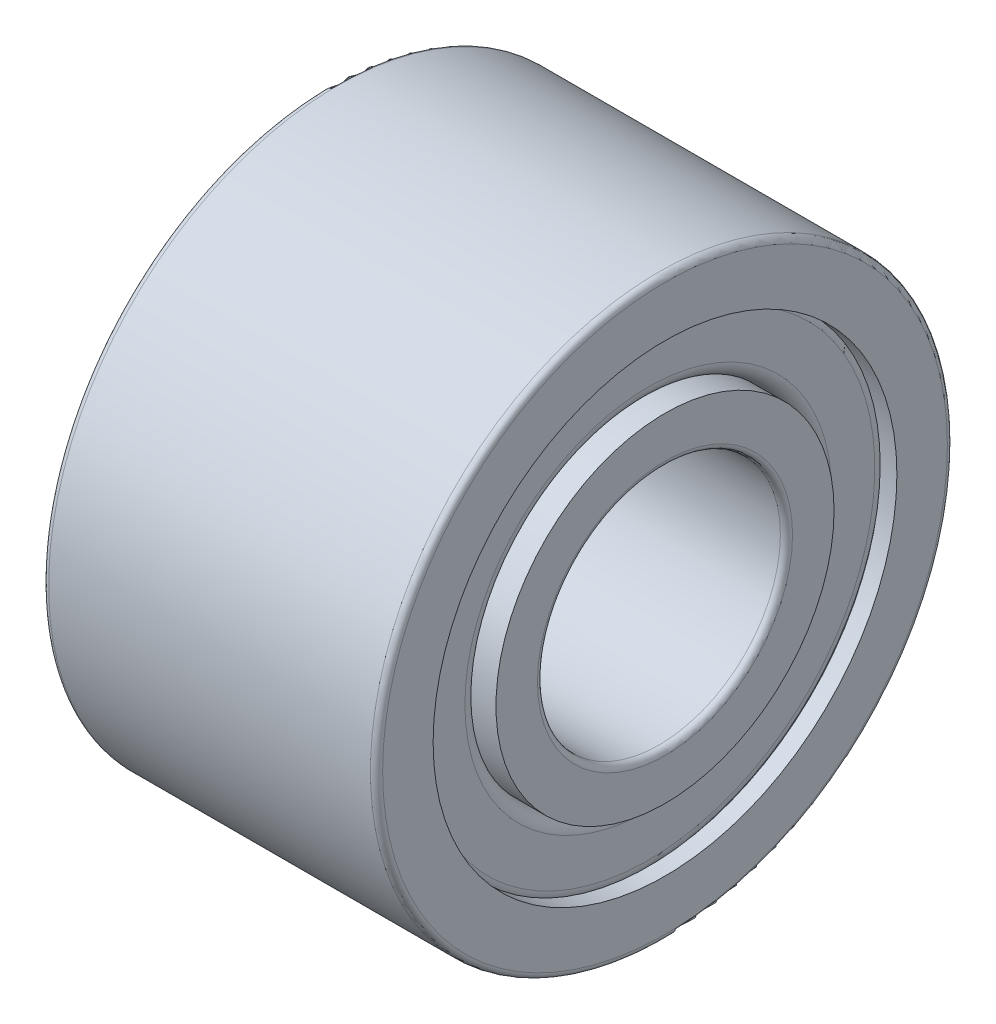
from build123d import *


with BuildPart() as part:
    # OutRacSke → OuterRace (revolve)
    with BuildSketch(Plane.XY, mode=Mode.PRIVATE) as outerrace_sk:
        with BuildLine():
            Line((-4.95, 7.9325), (-4.95, 7.636875))
            Line((-4.95, 7.636875), (-5.5, 7.636875))
            Line((-5.5, 7.636875), (-5.5, 9.3))
            ThreePointArc((-5.5, 9.3), (-5.441421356, 9.441421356), (-5.3, 9.5))
            Line((-5.3, 9.5), (5.3, 9.5))
            ThreePointArc((5.3, 9.5), (5.441421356, 9.441421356), (5.5, 9.3))
            Line((5.5, 9.3), (5.5, 7.636875))
            Line((5.5, 7.636875), (4.95, 7.636875))
            Line((4.95, 7.636875), (4.95, 7.9325))
            Line((4.95, 7.9325), (-4.95, 7.9325))
        make_face()
    revolve(outerrace_sk.sketch.rotate(Axis((-7.9375, 0, 0), (1, 0, 0)), 270), axis=Axis((-7.9375, 0, 0), (1, 0, 0)))

    # RolSimSke → RollersSimplified (revolve)
    with BuildSketch(Plane(origin=(0, 25.4, 0), x_dir=(1, 0, 0), z_dir=(0, 0, 1)), mode=Mode.PRIVATE) as rollerssimplified_sk:
        with BuildLine():
            Line((-4.95, -17.9397), (-4.95, -19.3593))
            ThreePointArc((-4.95, -19.3593), (-4.811402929, -19.693902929), (-4.4768, -19.8325))
            Line((-4.4768, -19.8325), (4.4768, -19.8325))
            ThreePointArc((4.4768, -19.8325), (4.811402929, -19.693902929), (4.95, -19.3593))
            Line((4.95, -19.3593), (4.95, -17.9397))
            ThreePointArc((4.95, -17.9397), (4.811402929, -17.605097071), (4.4768, -17.4665))
            Line((4.4768, -17.4665), (-4.4768, -17.4665))
            ThreePointArc((-4.4768, -17.4665), (-4.811402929, -17.605097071), (-4.95, -17.9397))
        make_face()
    revolve(rollerssimplified_sk.sketch.rotate(Axis((-25.4, 0, 0), (1, 0, 0)), 90), axis=Axis((-25.4, 0, 0), (1, 0, 0)))

    # InsRacSke → InnerRace (revolve)
    with BuildSketch(Plane.XY, mode=Mode.PRIVATE) as innerrace_sk:
        with BuildLine():
            Line((-5.5, 5.5675), (-5.5, 4.2))
            ThreePointArc((-5.5, 4.2), (-5.441421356, 4.058578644), (-5.3, 4))
            Line((-5.3, 4), (5.3, 4))
            ThreePointArc((5.3, 4), (5.441421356, 4.058578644), (5.5, 4.2))
            Line((5.5, 4.2), (5.5, 5.5675))
            Line((5.5, 5.5675), (-5.5, 5.5675))
        make_face()
    revolve(innerrace_sk.sketch.rotate(Axis((-7.9375, 0, 0), (1, 0, 0)), 270), axis=Axis((-7.9375, 0, 0), (1, 0, 0)))


solid = part.part
